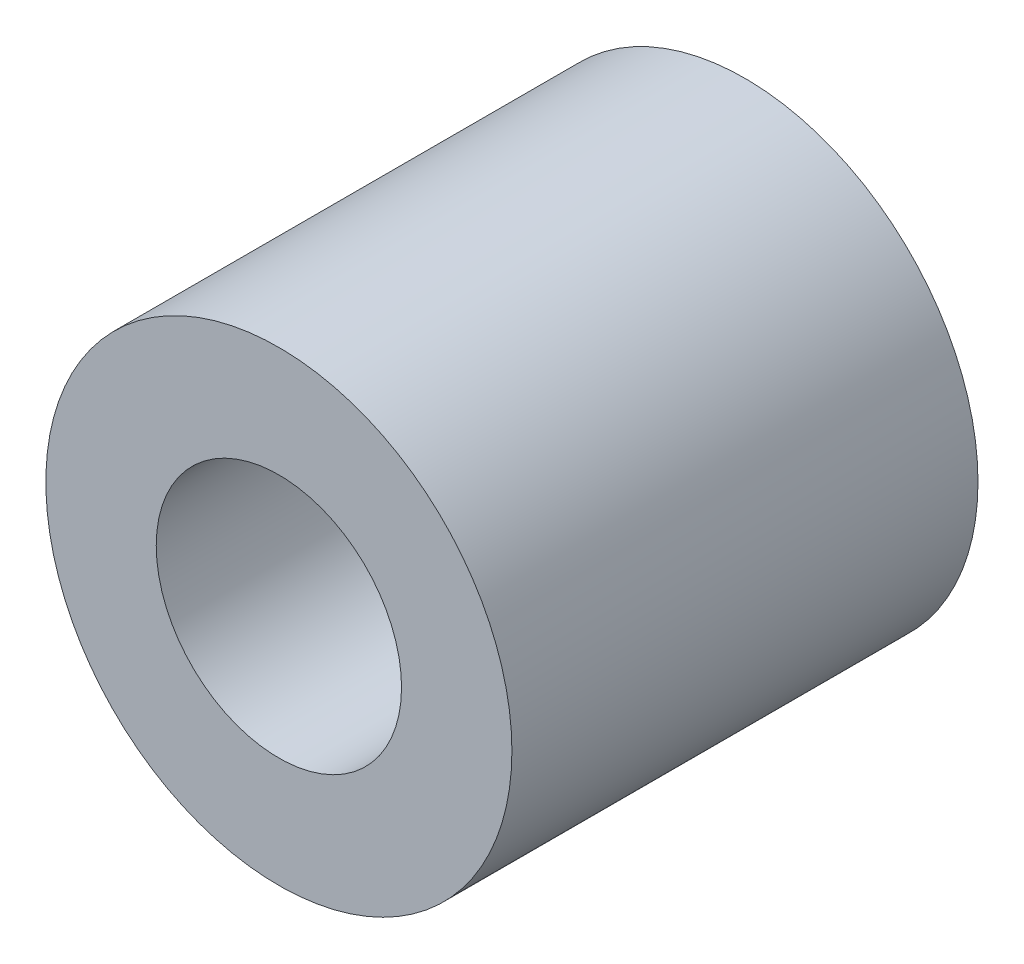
from build123d import *

# Parameters (mm, degrees)
SKETCH1_R          = 4.75
EXTRUDE1_DEPTH     = 9.5
SKETCH2_R          = 2.5
CUT_EXTRUDE1_DEPTH = 12.635076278


with BuildPart() as part:
    # Sketch1 → Extrude1 (new body)
    with BuildSketch(Plane.XY):
        Circle(SKETCH1_R)
    extrude(amount=-EXTRUDE1_DEPTH)

    # Sketch2 → Cut-Extrude1 (cut, through all)
    with BuildSketch(Plane.XY):
        Circle(SKETCH2_R)
    extrude(amount=-CUT_EXTRUDE1_DEPTH, mode=Mode.SUBTRACT)


solid = part.part
